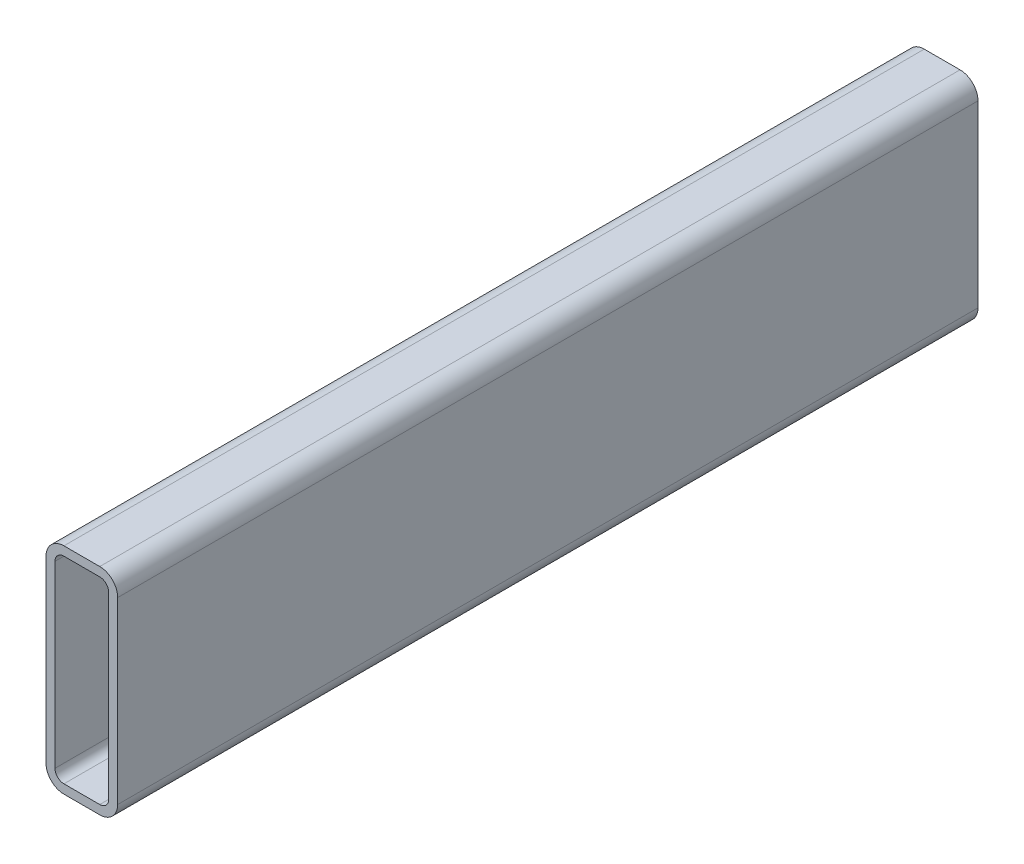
ISO-10303-21;
HEADER;
FILE_DESCRIPTION(('STEP AP214'),'2;1');
FILE_NAME('part.step','',(''),(''),'','','');
FILE_SCHEMA(('AUTOMOTIVE_DESIGN { 1 0 10303 214 1 1 1 1 }'));
ENDSEC;
DATA;
#1=APPLICATION_CONTEXT('core data for automotive mechanical design processes');
#2=APPLICATION_PROTOCOL_DEFINITION('international standard','automotive_design',2000,#1);
#3=PRODUCT_CONTEXT('',#1,'mechanical');
#4=PRODUCT('Part','Part','',(#3));
#5=PRODUCT_RELATED_PRODUCT_CATEGORY('part','',(#4));
#6=PRODUCT_DEFINITION_FORMATION('','',#4);
#7=PRODUCT_DEFINITION_CONTEXT('part definition',#1,'design');
#8=PRODUCT_DEFINITION('design','',#6,#7);
#9=PRODUCT_DEFINITION_SHAPE('','',#8);
#10=(LENGTH_UNIT() NAMED_UNIT(*) SI_UNIT(.MILLI.,.METRE.));
#11=(NAMED_UNIT(*) PLANE_ANGLE_UNIT() SI_UNIT($,.RADIAN.));
#12=(NAMED_UNIT(*) SI_UNIT($,.STERADIAN.) SOLID_ANGLE_UNIT());
#13=UNCERTAINTY_MEASURE_WITH_UNIT(LENGTH_MEASURE(1.E-05),#10,'distance_accuracy_value','');
#14=(GEOMETRIC_REPRESENTATION_CONTEXT(3) GLOBAL_UNCERTAINTY_ASSIGNED_CONTEXT((#13)) GLOBAL_UNIT_ASSIGNED_CONTEXT((#10,
#11,#12)) REPRESENTATION_CONTEXT('',''));
#15=CARTESIAN_POINT('',(0.,0.,0.));
#16=DIRECTION('',(0.,0.,1.));
#17=DIRECTION('',(1.,0.,0.));
#18=AXIS2_PLACEMENT_3D('',#15,#16,#17);
#19=CARTESIAN_POINT('',(6.35,69.85,304.8));
#20=DIRECTION('',(0.,0.,1.));
#21=DIRECTION('',(1.,0.,0.));
#22=AXIS2_PLACEMENT_3D('',#19,#20,#21);
#23=PLANE('',#22);
#24=CARTESIAN_POINT('',(6.35,69.85,304.8));
#25=DIRECTION('',(0.,0.,1.));
#26=DIRECTION('',(1.,0.,0.));
#27=AXIS2_PLACEMENT_3D('',#24,#25,#26);
#28=CIRCLE('',#27,6.35);
#29=CARTESIAN_POINT('',(6.35,76.2,304.8));
#30=VERTEX_POINT('',#29);
#31=CARTESIAN_POINT('',(0.,69.85,304.8));
#32=VERTEX_POINT('',#31);
#33=EDGE_CURVE('E211',#30,#32,#28,.T.);
#34=ORIENTED_EDGE('',*,*,#33,.T.);
#35=DIRECTION('',(0.,-1.,0.));
#36=VECTOR('',#35,1.);
#37=CARTESIAN_POINT('',(0.,6.35,304.8));
#38=LINE('',#37,#36);
#39=CARTESIAN_POINT('',(0.,6.35,304.8));
#40=VERTEX_POINT('',#39);
#41=EDGE_CURVE('E214',#32,#40,#38,.T.);
#42=ORIENTED_EDGE('',*,*,#41,.T.);
#43=CARTESIAN_POINT('',(6.35,6.35,304.8));
#44=DIRECTION('',(0.,0.,1.));
#45=DIRECTION('',(1.,0.,0.));
#46=AXIS2_PLACEMENT_3D('',#43,#44,#45);
#47=CIRCLE('',#46,6.35);
#48=CARTESIAN_POINT('',(6.35,0.,304.8));
#49=VERTEX_POINT('',#48);
#50=EDGE_CURVE('E217',#40,#49,#47,.T.);
#51=ORIENTED_EDGE('',*,*,#50,.T.);
#52=DIRECTION('',(1.,0.,0.));
#53=VECTOR('',#52,1.);
#54=CARTESIAN_POINT('',(19.05,0.,304.8));
#55=LINE('',#54,#53);
#56=CARTESIAN_POINT('',(19.05,0.,304.8));
#57=VERTEX_POINT('',#56);
#58=EDGE_CURVE('E219',#49,#57,#55,.T.);
#59=ORIENTED_EDGE('',*,*,#58,.T.);
#60=CARTESIAN_POINT('',(19.05,6.35,304.8));
#61=DIRECTION('',(0.,0.,1.));
#62=DIRECTION('',(1.,0.,0.));
#63=AXIS2_PLACEMENT_3D('',#60,#61,#62);
#64=CIRCLE('',#63,6.34999999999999);
#65=CARTESIAN_POINT('',(25.4,6.35,304.8));
#66=VERTEX_POINT('',#65);
#67=EDGE_CURVE('E221',#57,#66,#64,.T.);
#68=ORIENTED_EDGE('',*,*,#67,.T.);
#69=DIRECTION('',(0.,1.,0.));
#70=VECTOR('',#69,1.);
#71=CARTESIAN_POINT('',(25.4,69.85,304.8));
#72=LINE('',#71,#70);
#73=CARTESIAN_POINT('',(25.4,69.85,304.8));
#74=VERTEX_POINT('',#73);
#75=EDGE_CURVE('E223',#66,#74,#72,.T.);
#76=ORIENTED_EDGE('',*,*,#75,.T.);
#77=CARTESIAN_POINT('',(19.05,69.85,304.8));
#78=DIRECTION('',(0.,0.,1.));
#79=DIRECTION('',(1.,0.,0.));
#80=AXIS2_PLACEMENT_3D('',#77,#78,#79);
#81=CIRCLE('',#80,6.35);
#82=CARTESIAN_POINT('',(19.05,76.2,304.8));
#83=VERTEX_POINT('',#82);
#84=EDGE_CURVE('E225',#74,#83,#81,.T.);
#85=ORIENTED_EDGE('',*,*,#84,.T.);
#86=DIRECTION('',(-1.,0.,0.));
#87=VECTOR('',#86,1.);
#88=CARTESIAN_POINT('',(6.35,76.2,304.8));
#89=LINE('',#88,#87);
#90=EDGE_CURVE('E227',#83,#30,#89,.T.);
#91=ORIENTED_EDGE('',*,*,#90,.T.);
#92=EDGE_LOOP('',(#34,#42,#51,#59,#68,#76,#85,#91));
#93=FACE_BOUND('',#92,.T.);
#94=DIRECTION('',(0.,-1.,0.));
#95=VECTOR('',#94,1.);
#96=CARTESIAN_POINT('',(3.175,6.35,304.8));
#97=LINE('',#96,#95);
#98=CARTESIAN_POINT('',(3.175,69.85,304.8));
#99=VERTEX_POINT('',#98);
#100=CARTESIAN_POINT('',(3.175,6.35,304.8));
#101=VERTEX_POINT('',#100);
#102=EDGE_CURVE('E154',#99,#101,#97,.T.);
#103=ORIENTED_EDGE('',*,*,#102,.F.);
#104=CARTESIAN_POINT('',(6.35,69.85,304.8));
#105=DIRECTION('',(0.,0.,1.));
#106=DIRECTION('',(1.,0.,0.));
#107=AXIS2_PLACEMENT_3D('',#104,#105,#106);
#108=CIRCLE('',#107,3.175);
#109=CARTESIAN_POINT('',(6.35,73.025,304.8));
#110=VERTEX_POINT('',#109);
#111=EDGE_CURVE('E146',#110,#99,#108,.T.);
#112=ORIENTED_EDGE('',*,*,#111,.F.);
#113=DIRECTION('',(-1.,0.,0.));
#114=VECTOR('',#113,1.);
#115=CARTESIAN_POINT('',(6.35,73.025,304.8));
#116=LINE('',#115,#114);
#117=CARTESIAN_POINT('',(19.05,73.025,304.8));
#118=VERTEX_POINT('',#117);
#119=EDGE_CURVE('E179',#118,#110,#116,.T.);
#120=ORIENTED_EDGE('',*,*,#119,.F.);
#121=CARTESIAN_POINT('',(19.05,69.85,304.8));
#122=DIRECTION('',(0.,0.,1.));
#123=DIRECTION('',(1.,0.,0.));
#124=AXIS2_PLACEMENT_3D('',#121,#122,#123);
#125=CIRCLE('',#124,3.175);
#126=CARTESIAN_POINT('',(22.225,69.85,304.8));
#127=VERTEX_POINT('',#126);
#128=EDGE_CURVE('E177',#127,#118,#125,.T.);
#129=ORIENTED_EDGE('',*,*,#128,.F.);
#130=DIRECTION('',(0.,1.,0.));
#131=VECTOR('',#130,1.);
#132=CARTESIAN_POINT('',(22.225,69.85,304.8));
#133=LINE('',#132,#131);
#134=CARTESIAN_POINT('',(22.225,6.35,304.8));
#135=VERTEX_POINT('',#134);
#136=EDGE_CURVE('E175',#135,#127,#133,.T.);
#137=ORIENTED_EDGE('',*,*,#136,.F.);
#138=CARTESIAN_POINT('',(19.05,6.35,304.8));
#139=DIRECTION('',(0.,0.,1.));
#140=DIRECTION('',(1.,0.,0.));
#141=AXIS2_PLACEMENT_3D('',#138,#139,#140);
#142=CIRCLE('',#141,3.17499999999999);
#143=CARTESIAN_POINT('',(19.05,3.175,304.8));
#144=VERTEX_POINT('',#143);
#145=EDGE_CURVE('E173',#144,#135,#142,.T.);
#146=ORIENTED_EDGE('',*,*,#145,.F.);
#147=DIRECTION('',(1.,0.,0.));
#148=VECTOR('',#147,1.);
#149=CARTESIAN_POINT('',(19.05,3.175,304.8));
#150=LINE('',#149,#148);
#151=CARTESIAN_POINT('',(6.35,3.175,304.8));
#152=VERTEX_POINT('',#151);
#153=EDGE_CURVE('E169',#152,#144,#150,.T.);
#154=ORIENTED_EDGE('',*,*,#153,.F.);
#155=CARTESIAN_POINT('',(6.35,6.35,304.8));
#156=DIRECTION('',(0.,0.,1.));
#157=DIRECTION('',(1.,0.,0.));
#158=AXIS2_PLACEMENT_3D('',#155,#156,#157);
#159=CIRCLE('',#158,3.175);
#160=EDGE_CURVE('E167',#101,#152,#159,.T.);
#161=ORIENTED_EDGE('',*,*,#160,.F.);
#162=EDGE_LOOP('',(#103,#112,#120,#129,#137,#146,#154,#161));
#163=FACE_BOUND('',#162,.T.);
#164=ADVANCED_FACE('F33',(#93,#163),#23,.T.);
#165=CARTESIAN_POINT('',(6.35,69.85,0.));
#166=DIRECTION('',(0.,0.,1.));
#167=DIRECTION('',(1.,0.,0.));
#168=AXIS2_PLACEMENT_3D('',#165,#166,#167);
#169=PLANE('',#168);
#170=CARTESIAN_POINT('',(6.35,69.85,0.));
#171=DIRECTION('',(0.,0.,1.));
#172=DIRECTION('',(1.,0.,0.));
#173=AXIS2_PLACEMENT_3D('',#170,#171,#172);
#174=CIRCLE('',#173,6.35);
#175=CARTESIAN_POINT('',(6.35,76.2,0.));
#176=VERTEX_POINT('',#175);
#177=CARTESIAN_POINT('',(0.,69.85,0.));
#178=VERTEX_POINT('',#177);
#179=EDGE_CURVE('E162',#176,#178,#174,.T.);
#180=ORIENTED_EDGE('',*,*,#179,.F.);
#181=DIRECTION('',(-1.,0.,0.));
#182=VECTOR('',#181,1.);
#183=CARTESIAN_POINT('',(6.35,76.2,0.));
#184=LINE('',#183,#182);
#185=CARTESIAN_POINT('',(19.05,76.2,0.));
#186=VERTEX_POINT('',#185);
#187=EDGE_CURVE('E215',#186,#176,#184,.T.);
#188=ORIENTED_EDGE('',*,*,#187,.F.);
#189=CARTESIAN_POINT('',(19.05,69.85,0.));
#190=DIRECTION('',(0.,0.,1.));
#191=DIRECTION('',(1.,0.,0.));
#192=AXIS2_PLACEMENT_3D('',#189,#190,#191);
#193=CIRCLE('',#192,6.35);
#194=CARTESIAN_POINT('',(25.4,69.85,0.));
#195=VERTEX_POINT('',#194);
#196=EDGE_CURVE('E242',#195,#186,#193,.T.);
#197=ORIENTED_EDGE('',*,*,#196,.F.);
#198=DIRECTION('',(0.,1.,0.));
#199=VECTOR('',#198,1.);
#200=CARTESIAN_POINT('',(25.4,69.85,0.));
#201=LINE('',#200,#199);
#202=CARTESIAN_POINT('',(25.4,6.35,0.));
#203=VERTEX_POINT('',#202);
#204=EDGE_CURVE('E240',#203,#195,#201,.T.);
#205=ORIENTED_EDGE('',*,*,#204,.F.);
#206=CARTESIAN_POINT('',(19.05,6.35,0.));
#207=DIRECTION('',(0.,0.,1.));
#208=DIRECTION('',(1.,0.,0.));
#209=AXIS2_PLACEMENT_3D('',#206,#207,#208);
#210=CIRCLE('',#209,6.34999999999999);
#211=CARTESIAN_POINT('',(19.05,0.,0.));
#212=VERTEX_POINT('',#211);
#213=EDGE_CURVE('E238',#212,#203,#210,.T.);
#214=ORIENTED_EDGE('',*,*,#213,.F.);
#215=DIRECTION('',(1.,0.,0.));
#216=VECTOR('',#215,1.);
#217=CARTESIAN_POINT('',(19.05,0.,0.));
#218=LINE('',#217,#216);
#219=CARTESIAN_POINT('',(6.35,0.,0.));
#220=VERTEX_POINT('',#219);
#221=EDGE_CURVE('E236',#220,#212,#218,.T.);
#222=ORIENTED_EDGE('',*,*,#221,.F.);
#223=CARTESIAN_POINT('',(6.35,6.35,0.));
#224=DIRECTION('',(0.,0.,1.));
#225=DIRECTION('',(1.,0.,0.));
#226=AXIS2_PLACEMENT_3D('',#223,#224,#225);
#227=CIRCLE('',#226,6.35);
#228=CARTESIAN_POINT('',(0.,6.35,0.));
#229=VERTEX_POINT('',#228);
#230=EDGE_CURVE('E234',#229,#220,#227,.T.);
#231=ORIENTED_EDGE('',*,*,#230,.F.);
#232=DIRECTION('',(0.,-1.,0.));
#233=VECTOR('',#232,1.);
#234=CARTESIAN_POINT('',(0.,6.35,0.));
#235=LINE('',#234,#233);
#236=EDGE_CURVE('E232',#178,#229,#235,.T.);
#237=ORIENTED_EDGE('',*,*,#236,.F.);
#238=EDGE_LOOP('',(#180,#188,#197,#205,#214,#222,#231,#237));
#239=FACE_BOUND('',#238,.T.);
#240=CARTESIAN_POINT('',(6.35,69.85,0.));
#241=DIRECTION('',(0.,0.,1.));
#242=DIRECTION('',(1.,0.,0.));
#243=AXIS2_PLACEMENT_3D('',#240,#241,#242);
#244=CIRCLE('',#243,3.175);
#245=CARTESIAN_POINT('',(6.35,73.025,0.));
#246=VERTEX_POINT('',#245);
#247=CARTESIAN_POINT('',(3.175,69.85,0.));
#248=VERTEX_POINT('',#247);
#249=EDGE_CURVE('E56',#246,#248,#244,.T.);
#250=ORIENTED_EDGE('',*,*,#249,.T.);
#251=DIRECTION('',(0.,-1.,0.));
#252=VECTOR('',#251,1.);
#253=CARTESIAN_POINT('',(3.175,6.35,0.));
#254=LINE('',#253,#252);
#255=CARTESIAN_POINT('',(3.175,6.35,0.));
#256=VERTEX_POINT('',#255);
#257=EDGE_CURVE('E161',#248,#256,#254,.T.);
#258=ORIENTED_EDGE('',*,*,#257,.T.);
#259=CARTESIAN_POINT('',(6.35,6.35,0.));
#260=DIRECTION('',(0.,0.,1.));
#261=DIRECTION('',(1.,0.,0.));
#262=AXIS2_PLACEMENT_3D('',#259,#260,#261);
#263=CIRCLE('',#262,3.175);
#264=CARTESIAN_POINT('',(6.35,3.175,0.));
#265=VERTEX_POINT('',#264);
#266=EDGE_CURVE('E183',#256,#265,#263,.T.);
#267=ORIENTED_EDGE('',*,*,#266,.T.);
#268=DIRECTION('',(1.,0.,0.));
#269=VECTOR('',#268,1.);
#270=CARTESIAN_POINT('',(19.05,3.175,0.));
#271=LINE('',#270,#269);
#272=CARTESIAN_POINT('',(19.05,3.175,0.));
#273=VERTEX_POINT('',#272);
#274=EDGE_CURVE('E186',#265,#273,#271,.T.);
#275=ORIENTED_EDGE('',*,*,#274,.T.);
#276=CARTESIAN_POINT('',(19.05,6.35,0.));
#277=DIRECTION('',(0.,0.,1.));
#278=DIRECTION('',(1.,0.,0.));
#279=AXIS2_PLACEMENT_3D('',#276,#277,#278);
#280=CIRCLE('',#279,3.17499999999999);
#281=CARTESIAN_POINT('',(22.225,6.35,0.));
#282=VERTEX_POINT('',#281);
#283=EDGE_CURVE('E189',#273,#282,#280,.T.);
#284=ORIENTED_EDGE('',*,*,#283,.T.);
#285=DIRECTION('',(0.,1.,0.));
#286=VECTOR('',#285,1.);
#287=CARTESIAN_POINT('',(22.225,69.85,0.));
#288=LINE('',#287,#286);
#289=CARTESIAN_POINT('',(22.225,69.85,0.));
#290=VERTEX_POINT('',#289);
#291=EDGE_CURVE('E192',#282,#290,#288,.T.);
#292=ORIENTED_EDGE('',*,*,#291,.T.);
#293=CARTESIAN_POINT('',(19.05,69.85,0.));
#294=DIRECTION('',(0.,0.,1.));
#295=DIRECTION('',(1.,0.,0.));
#296=AXIS2_PLACEMENT_3D('',#293,#294,#295);
#297=CIRCLE('',#296,3.175);
#298=CARTESIAN_POINT('',(19.05,73.025,0.));
#299=VERTEX_POINT('',#298);
#300=EDGE_CURVE('E195',#290,#299,#297,.T.);
#301=ORIENTED_EDGE('',*,*,#300,.T.);
#302=DIRECTION('',(-1.,0.,0.));
#303=VECTOR('',#302,1.);
#304=CARTESIAN_POINT('',(6.35,73.025,0.));
#305=LINE('',#304,#303);
#306=EDGE_CURVE('E155',#299,#246,#305,.T.);
#307=ORIENTED_EDGE('',*,*,#306,.T.);
#308=EDGE_LOOP('',(#250,#258,#267,#275,#284,#292,#301,#307));
#309=FACE_BOUND('',#308,.T.);
#310=ADVANCED_FACE('F272',(#239,#309),#169,.F.);
#311=CARTESIAN_POINT('',(6.35,69.85,304.8));
#312=DIRECTION('',(0.,0.,-1.));
#313=DIRECTION('',(-1.,0.,0.));
#314=AXIS2_PLACEMENT_3D('',#311,#312,#313);
#315=CYLINDRICAL_SURFACE('',#314,6.35);
#316=ORIENTED_EDGE('',*,*,#179,.T.);
#317=DIRECTION('',(0.,0.,-1.));
#318=VECTOR('',#317,1.);
#319=CARTESIAN_POINT('',(0.,69.85,304.8));
#320=LINE('',#319,#318);
#321=EDGE_CURVE('E11',#32,#178,#320,.T.);
#322=ORIENTED_EDGE('',*,*,#321,.F.);
#323=ORIENTED_EDGE('',*,*,#33,.F.);
#324=DIRECTION('',(0.,0.,-1.));
#325=VECTOR('',#324,1.);
#326=CARTESIAN_POINT('',(6.35,76.2,304.8));
#327=LINE('',#326,#325);
#328=EDGE_CURVE('E229',#30,#176,#327,.T.);
#329=ORIENTED_EDGE('',*,*,#328,.T.);
#330=EDGE_LOOP('',(#316,#322,#323,#329));
#331=FACE_BOUND('',#330,.T.);
#332=ADVANCED_FACE('F35',(#331),#315,.T.);
#333=CARTESIAN_POINT('',(0.,6.35,304.8));
#334=DIRECTION('',(1.,0.,0.));
#335=DIRECTION('',(0.,0.,-1.));
#336=AXIS2_PLACEMENT_3D('',#333,#334,#335);
#337=PLANE('',#336);
#338=ORIENTED_EDGE('',*,*,#236,.T.);
#339=DIRECTION('',(0.,0.,-1.));
#340=VECTOR('',#339,1.);
#341=CARTESIAN_POINT('',(0.,6.35,304.8));
#342=LINE('',#341,#340);
#343=EDGE_CURVE('E41',#40,#229,#342,.T.);
#344=ORIENTED_EDGE('',*,*,#343,.F.);
#345=ORIENTED_EDGE('',*,*,#41,.F.);
#346=ORIENTED_EDGE('',*,*,#321,.T.);
#347=EDGE_LOOP('',(#338,#344,#345,#346));
#348=FACE_BOUND('',#347,.T.);
#349=ADVANCED_FACE('F289',(#348),#337,.F.);
#350=CARTESIAN_POINT('',(6.35,6.35,304.8));
#351=DIRECTION('',(0.,0.,-1.));
#352=DIRECTION('',(-1.,0.,0.));
#353=AXIS2_PLACEMENT_3D('',#350,#351,#352);
#354=CYLINDRICAL_SURFACE('',#353,6.35);
#355=ORIENTED_EDGE('',*,*,#230,.T.);
#356=DIRECTION('',(0.,0.,-1.));
#357=VECTOR('',#356,1.);
#358=CARTESIAN_POINT('',(6.35,0.,304.8));
#359=LINE('',#358,#357);
#360=EDGE_CURVE('E259',#49,#220,#359,.T.);
#361=ORIENTED_EDGE('',*,*,#360,.F.);
#362=ORIENTED_EDGE('',*,*,#50,.F.);
#363=ORIENTED_EDGE('',*,*,#343,.T.);
#364=EDGE_LOOP('',(#355,#361,#362,#363));
#365=FACE_BOUND('',#364,.T.);
#366=ADVANCED_FACE('F266',(#365),#354,.T.);
#367=CARTESIAN_POINT('',(19.05,0.,304.8));
#368=DIRECTION('',(0.,1.,0.));
#369=DIRECTION('',(0.,0.,1.));
#370=AXIS2_PLACEMENT_3D('',#367,#368,#369);
#371=PLANE('',#370);
#372=ORIENTED_EDGE('',*,*,#221,.T.);
#373=DIRECTION('',(0.,0.,-1.));
#374=VECTOR('',#373,1.);
#375=CARTESIAN_POINT('',(19.05,0.,304.8));
#376=LINE('',#375,#374);
#377=EDGE_CURVE('E256',#57,#212,#376,.T.);
#378=ORIENTED_EDGE('',*,*,#377,.F.);
#379=ORIENTED_EDGE('',*,*,#58,.F.);
#380=ORIENTED_EDGE('',*,*,#360,.T.);
#381=EDGE_LOOP('',(#372,#378,#379,#380));
#382=FACE_BOUND('',#381,.T.);
#383=ADVANCED_FACE('F278',(#382),#371,.F.);
#384=CARTESIAN_POINT('',(19.05,6.35,304.8));
#385=DIRECTION('',(0.,0.,-1.));
#386=DIRECTION('',(-1.,0.,0.));
#387=AXIS2_PLACEMENT_3D('',#384,#385,#386);
#388=CYLINDRICAL_SURFACE('',#387,6.34999999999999);
#389=ORIENTED_EDGE('',*,*,#213,.T.);
#390=DIRECTION('',(0.,0.,-1.));
#391=VECTOR('',#390,1.);
#392=CARTESIAN_POINT('',(25.4,6.35,304.8));
#393=LINE('',#392,#391);
#394=EDGE_CURVE('E253',#66,#203,#393,.T.);
#395=ORIENTED_EDGE('',*,*,#394,.F.);
#396=ORIENTED_EDGE('',*,*,#67,.F.);
#397=ORIENTED_EDGE('',*,*,#377,.T.);
#398=EDGE_LOOP('',(#389,#395,#396,#397));
#399=FACE_BOUND('',#398,.T.);
#400=ADVANCED_FACE('F282',(#399),#388,.T.);
#401=CARTESIAN_POINT('',(25.4,69.85,304.8));
#402=DIRECTION('',(-1.,0.,0.));
#403=DIRECTION('',(0.,0.,1.));
#404=AXIS2_PLACEMENT_3D('',#401,#402,#403);
#405=PLANE('',#404);
#406=ORIENTED_EDGE('',*,*,#204,.T.);
#407=DIRECTION('',(0.,0.,-1.));
#408=VECTOR('',#407,1.);
#409=CARTESIAN_POINT('',(25.4,69.85,304.8));
#410=LINE('',#409,#408);
#411=EDGE_CURVE('E250',#74,#195,#410,.T.);
#412=ORIENTED_EDGE('',*,*,#411,.F.);
#413=ORIENTED_EDGE('',*,*,#75,.F.);
#414=ORIENTED_EDGE('',*,*,#394,.T.);
#415=EDGE_LOOP('',(#406,#412,#413,#414));
#416=FACE_BOUND('',#415,.T.);
#417=ADVANCED_FACE('F302',(#416),#405,.F.);
#418=CARTESIAN_POINT('',(19.05,69.85,304.8));
#419=DIRECTION('',(0.,0.,-1.));
#420=DIRECTION('',(-1.,0.,0.));
#421=AXIS2_PLACEMENT_3D('',#418,#419,#420);
#422=CYLINDRICAL_SURFACE('',#421,6.35);
#423=ORIENTED_EDGE('',*,*,#196,.T.);
#424=DIRECTION('',(0.,0.,-1.));
#425=VECTOR('',#424,1.);
#426=CARTESIAN_POINT('',(19.05,76.2,304.8));
#427=LINE('',#426,#425);
#428=EDGE_CURVE('E247',#83,#186,#427,.T.);
#429=ORIENTED_EDGE('',*,*,#428,.F.);
#430=ORIENTED_EDGE('',*,*,#84,.F.);
#431=ORIENTED_EDGE('',*,*,#411,.T.);
#432=EDGE_LOOP('',(#423,#429,#430,#431));
#433=FACE_BOUND('',#432,.T.);
#434=ADVANCED_FACE('F300',(#433),#422,.T.);
#435=CARTESIAN_POINT('',(6.35,76.2,304.8));
#436=DIRECTION('',(0.,-1.,0.));
#437=DIRECTION('',(0.,0.,-1.));
#438=AXIS2_PLACEMENT_3D('',#435,#436,#437);
#439=PLANE('',#438);
#440=ORIENTED_EDGE('',*,*,#187,.T.);
#441=ORIENTED_EDGE('',*,*,#328,.F.);
#442=ORIENTED_EDGE('',*,*,#90,.F.);
#443=ORIENTED_EDGE('',*,*,#428,.T.);
#444=EDGE_LOOP('',(#440,#441,#442,#443));
#445=FACE_BOUND('',#444,.T.);
#446=ADVANCED_FACE('F295',(#445),#439,.F.);
#447=CARTESIAN_POINT('',(6.35,69.85,304.8));
#448=DIRECTION('',(0.,0.,-1.));
#449=DIRECTION('',(-1.,0.,0.));
#450=AXIS2_PLACEMENT_3D('',#447,#448,#449);
#451=CYLINDRICAL_SURFACE('',#450,3.175);
#452=ORIENTED_EDGE('',*,*,#249,.F.);
#453=DIRECTION('',(0.,0.,-1.));
#454=VECTOR('',#453,1.);
#455=CARTESIAN_POINT('',(6.35,73.025,304.8));
#456=LINE('',#455,#454);
#457=EDGE_CURVE('E150',#110,#246,#456,.T.);
#458=ORIENTED_EDGE('',*,*,#457,.F.);
#459=ORIENTED_EDGE('',*,*,#111,.T.);
#460=DIRECTION('',(0.,0.,-1.));
#461=VECTOR('',#460,1.);
#462=CARTESIAN_POINT('',(3.175,69.85,304.8));
#463=LINE('',#462,#461);
#464=EDGE_CURVE('E149',#99,#248,#463,.T.);
#465=ORIENTED_EDGE('',*,*,#464,.T.);
#466=EDGE_LOOP('',(#452,#458,#459,#465));
#467=FACE_BOUND('',#466,.T.);
#468=ADVANCED_FACE('F148',(#467),#451,.F.);
#469=CARTESIAN_POINT('',(3.175,6.35,304.8));
#470=DIRECTION('',(1.,0.,0.));
#471=DIRECTION('',(0.,0.,-1.));
#472=AXIS2_PLACEMENT_3D('',#469,#470,#471);
#473=PLANE('',#472);
#474=ORIENTED_EDGE('',*,*,#257,.F.);
#475=ORIENTED_EDGE('',*,*,#464,.F.);
#476=ORIENTED_EDGE('',*,*,#102,.T.);
#477=DIRECTION('',(0.,0.,-1.));
#478=VECTOR('',#477,1.);
#479=CARTESIAN_POINT('',(3.175,6.35,304.8));
#480=LINE('',#479,#478);
#481=EDGE_CURVE('E163',#101,#256,#480,.T.);
#482=ORIENTED_EDGE('',*,*,#481,.T.);
#483=EDGE_LOOP('',(#474,#475,#476,#482));
#484=FACE_BOUND('',#483,.T.);
#485=ADVANCED_FACE('F158',(#484),#473,.T.);
#486=CARTESIAN_POINT('',(6.35,6.35,304.8));
#487=DIRECTION('',(0.,0.,-1.));
#488=DIRECTION('',(-1.,0.,0.));
#489=AXIS2_PLACEMENT_3D('',#486,#487,#488);
#490=CYLINDRICAL_SURFACE('',#489,3.175);
#491=ORIENTED_EDGE('',*,*,#266,.F.);
#492=ORIENTED_EDGE('',*,*,#481,.F.);
#493=ORIENTED_EDGE('',*,*,#160,.T.);
#494=DIRECTION('',(0.,0.,-1.));
#495=VECTOR('',#494,1.);
#496=CARTESIAN_POINT('',(6.35,3.175,304.8));
#497=LINE('',#496,#495);
#498=EDGE_CURVE('E208',#152,#265,#497,.T.);
#499=ORIENTED_EDGE('',*,*,#498,.T.);
#500=EDGE_LOOP('',(#491,#492,#493,#499));
#501=FACE_BOUND('',#500,.T.);
#502=ADVANCED_FACE('F327',(#501),#490,.F.);
#503=CARTESIAN_POINT('',(19.05,3.175,304.8));
#504=DIRECTION('',(0.,1.,0.));
#505=DIRECTION('',(0.,0.,1.));
#506=AXIS2_PLACEMENT_3D('',#503,#504,#505);
#507=PLANE('',#506);
#508=ORIENTED_EDGE('',*,*,#274,.F.);
#509=ORIENTED_EDGE('',*,*,#498,.F.);
#510=ORIENTED_EDGE('',*,*,#153,.T.);
#511=DIRECTION('',(0.,0.,-1.));
#512=VECTOR('',#511,1.);
#513=CARTESIAN_POINT('',(19.05,3.175,304.8));
#514=LINE('',#513,#512);
#515=EDGE_CURVE('E206',#144,#273,#514,.T.);
#516=ORIENTED_EDGE('',*,*,#515,.T.);
#517=EDGE_LOOP('',(#508,#509,#510,#516));
#518=FACE_BOUND('',#517,.T.);
#519=ADVANCED_FACE('F331',(#518),#507,.T.);
#520=CARTESIAN_POINT('',(19.05,6.35,304.8));
#521=DIRECTION('',(0.,0.,-1.));
#522=DIRECTION('',(-1.,0.,0.));
#523=AXIS2_PLACEMENT_3D('',#520,#521,#522);
#524=CYLINDRICAL_SURFACE('',#523,3.17499999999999);
#525=ORIENTED_EDGE('',*,*,#283,.F.);
#526=ORIENTED_EDGE('',*,*,#515,.F.);
#527=ORIENTED_EDGE('',*,*,#145,.T.);
#528=DIRECTION('',(0.,0.,-1.));
#529=VECTOR('',#528,1.);
#530=CARTESIAN_POINT('',(22.225,6.35,304.8));
#531=LINE('',#530,#529);
#532=EDGE_CURVE('E204',#135,#282,#531,.T.);
#533=ORIENTED_EDGE('',*,*,#532,.T.);
#534=EDGE_LOOP('',(#525,#526,#527,#533));
#535=FACE_BOUND('',#534,.T.);
#536=ADVANCED_FACE('F337',(#535),#524,.F.);
#537=CARTESIAN_POINT('',(22.225,69.85,304.8));
#538=DIRECTION('',(-1.,0.,0.));
#539=DIRECTION('',(0.,0.,1.));
#540=AXIS2_PLACEMENT_3D('',#537,#538,#539);
#541=PLANE('',#540);
#542=ORIENTED_EDGE('',*,*,#291,.F.);
#543=ORIENTED_EDGE('',*,*,#532,.F.);
#544=ORIENTED_EDGE('',*,*,#136,.T.);
#545=DIRECTION('',(0.,0.,-1.));
#546=VECTOR('',#545,1.);
#547=CARTESIAN_POINT('',(22.225,69.85,304.8));
#548=LINE('',#547,#546);
#549=EDGE_CURVE('E202',#127,#290,#548,.T.);
#550=ORIENTED_EDGE('',*,*,#549,.T.);
#551=EDGE_LOOP('',(#542,#543,#544,#550));
#552=FACE_BOUND('',#551,.T.);
#553=ADVANCED_FACE('F341',(#552),#541,.T.);
#554=CARTESIAN_POINT('',(19.05,69.85,304.8));
#555=DIRECTION('',(0.,0.,-1.));
#556=DIRECTION('',(-1.,0.,0.));
#557=AXIS2_PLACEMENT_3D('',#554,#555,#556);
#558=CYLINDRICAL_SURFACE('',#557,3.175);
#559=ORIENTED_EDGE('',*,*,#300,.F.);
#560=ORIENTED_EDGE('',*,*,#549,.F.);
#561=ORIENTED_EDGE('',*,*,#128,.T.);
#562=DIRECTION('',(0.,0.,-1.));
#563=VECTOR('',#562,1.);
#564=CARTESIAN_POINT('',(19.05,73.025,304.8));
#565=LINE('',#564,#563);
#566=EDGE_CURVE('E48',#118,#299,#565,.T.);
#567=ORIENTED_EDGE('',*,*,#566,.T.);
#568=EDGE_LOOP('',(#559,#560,#561,#567));
#569=FACE_BOUND('',#568,.T.);
#570=ADVANCED_FACE('F345',(#569),#558,.F.);
#571=CARTESIAN_POINT('',(6.35,73.025,304.8));
#572=DIRECTION('',(0.,-1.,0.));
#573=DIRECTION('',(0.,0.,-1.));
#574=AXIS2_PLACEMENT_3D('',#571,#572,#573);
#575=PLANE('',#574);
#576=ORIENTED_EDGE('',*,*,#306,.F.);
#577=ORIENTED_EDGE('',*,*,#566,.F.);
#578=ORIENTED_EDGE('',*,*,#119,.T.);
#579=ORIENTED_EDGE('',*,*,#457,.T.);
#580=EDGE_LOOP('',(#576,#577,#578,#579));
#581=FACE_BOUND('',#580,.T.);
#582=ADVANCED_FACE('F349',(#581),#575,.T.);
#583=CLOSED_SHELL('',(#164,#310,#332,#349,#366,#383,#400,#417,#434,#446,#468,#485,#502,#519,
#536,#553,#570,#582));
#584=MANIFOLD_SOLID_BREP('B2',#583);
#585=ADVANCED_BREP_SHAPE_REPRESENTATION('',(#18,#584),#14);
#586=SHAPE_DEFINITION_REPRESENTATION(#9,#585);
ENDSEC;
END-ISO-10303-21;
